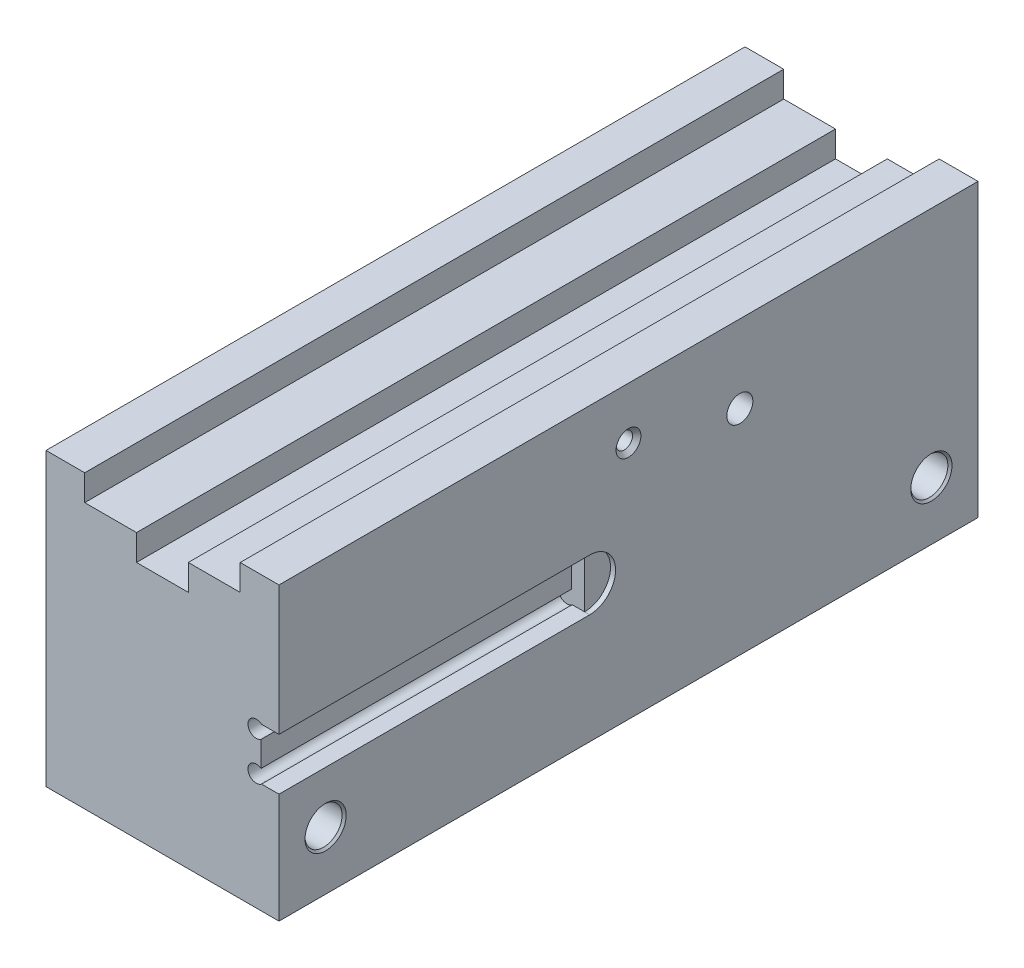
ISO-10303-21;
HEADER;
FILE_DESCRIPTION(('STEP AP214'),'2;1');
FILE_NAME('part.step','',(''),(''),'','','');
FILE_SCHEMA(('AUTOMOTIVE_DESIGN { 1 0 10303 214 1 1 1 1 }'));
ENDSEC;
DATA;
#1=APPLICATION_CONTEXT('core data for automotive mechanical design processes');
#2=APPLICATION_PROTOCOL_DEFINITION('international standard','automotive_design',2000,#1);
#3=PRODUCT_CONTEXT('',#1,'mechanical');
#4=PRODUCT('Part','Part','',(#3));
#5=PRODUCT_RELATED_PRODUCT_CATEGORY('part','',(#4));
#6=PRODUCT_DEFINITION_FORMATION('','',#4);
#7=PRODUCT_DEFINITION_CONTEXT('part definition',#1,'design');
#8=PRODUCT_DEFINITION('design','',#6,#7);
#9=PRODUCT_DEFINITION_SHAPE('','',#8);
#10=(LENGTH_UNIT() NAMED_UNIT(*) SI_UNIT(.MILLI.,.METRE.));
#11=(NAMED_UNIT(*) PLANE_ANGLE_UNIT() SI_UNIT($,.RADIAN.));
#12=(NAMED_UNIT(*) SI_UNIT($,.STERADIAN.) SOLID_ANGLE_UNIT());
#13=UNCERTAINTY_MEASURE_WITH_UNIT(LENGTH_MEASURE(1.E-05),#10,'distance_accuracy_value','');
#14=(GEOMETRIC_REPRESENTATION_CONTEXT(3) GLOBAL_UNCERTAINTY_ASSIGNED_CONTEXT((#13)) GLOBAL_UNIT_ASSIGNED_CONTEXT((#10,
#11,#12)) REPRESENTATION_CONTEXT('',''));
#15=CARTESIAN_POINT('',(0.,0.,0.));
#16=DIRECTION('',(0.,0.,1.));
#17=DIRECTION('',(1.,0.,0.));
#18=AXIS2_PLACEMENT_3D('',#15,#16,#17);
#19=CARTESIAN_POINT('',(51.5747,28.5623,-76.2));
#20=DIRECTION('',(0.,0.,1.));
#21=DIRECTION('',(1.,0.,0.));
#22=AXIS2_PLACEMENT_3D('',#19,#20,#21);
#23=PLANE('',#22);
#24=DIRECTION('',(1.,0.,0.));
#25=VECTOR('',#24,1.);
#26=CARTESIAN_POINT('',(52.8633589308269,26.9748,-76.2));
#27=LINE('',#26,#25);
#28=CARTESIAN_POINT('',(52.8633589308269,26.9748,-76.2));
#29=VERTEX_POINT('',#28);
#30=CARTESIAN_POINT('',(55.9181,26.9748,-76.2));
#31=VERTEX_POINT('',#30);
#32=EDGE_CURVE('E260',#29,#31,#27,.T.);
#33=ORIENTED_EDGE('',*,*,#32,.T.);
#34=DIRECTION('',(0.,1.,0.));
#35=VECTOR('',#34,1.);
#36=CARTESIAN_POINT('',(55.9181,28.5623,-76.2));
#37=LINE('',#36,#35);
#38=CARTESIAN_POINT('',(55.9181,39.6748,-76.2));
#39=VERTEX_POINT('',#38);
#40=EDGE_CURVE('E11',#31,#39,#37,.T.);
#41=ORIENTED_EDGE('',*,*,#40,.T.);
#42=DIRECTION('',(-1.,0.,0.));
#43=VECTOR('',#42,1.);
#44=CARTESIAN_POINT('',(52.8633589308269,39.6748,-76.2));
#45=LINE('',#44,#43);
#46=CARTESIAN_POINT('',(52.8633589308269,39.6748,-76.2));
#47=VERTEX_POINT('',#46);
#48=EDGE_CURVE('E263',#39,#47,#45,.T.);
#49=ORIENTED_EDGE('',*,*,#48,.T.);
#50=CARTESIAN_POINT('',(51.5747,38.0873,-76.2));
#51=DIRECTION('',(0.,0.,1.));
#52=DIRECTION('',(1.,0.,0.));
#53=AXIS2_PLACEMENT_3D('',#50,#51,#52);
#54=CIRCLE('',#53,2.04469999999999);
#55=CARTESIAN_POINT('',(52.7431,36.4093132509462,-76.2));
#56=VERTEX_POINT('',#55);
#57=EDGE_CURVE('E266',#47,#56,#54,.T.);
#58=ORIENTED_EDGE('',*,*,#57,.T.);
#59=DIRECTION('',(0.,-1.,0.));
#60=VECTOR('',#59,1.);
#61=CARTESIAN_POINT('',(52.7431,36.4093132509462,-76.2));
#62=LINE('',#61,#60);
#63=CARTESIAN_POINT('',(52.7431,30.2402867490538,-76.2));
#64=VERTEX_POINT('',#63);
#65=EDGE_CURVE('E269',#56,#64,#62,.T.);
#66=ORIENTED_EDGE('',*,*,#65,.T.);
#67=CARTESIAN_POINT('',(51.5747,28.5623,-76.2));
#68=DIRECTION('',(0.,0.,1.));
#69=DIRECTION('',(1.,0.,0.));
#70=AXIS2_PLACEMENT_3D('',#67,#68,#69);
#71=CIRCLE('',#70,2.0447);
#72=EDGE_CURVE('E255',#64,#29,#71,.T.);
#73=ORIENTED_EDGE('',*,*,#72,.T.);
#74=EDGE_LOOP('',(#33,#41,#49,#58,#66,#73));
#75=FACE_BOUND('',#74,.T.);
#76=ADVANCED_FACE('F37',(#75),#23,.T.);
#77=CARTESIAN_POINT('',(0.,71.4248,-171.45));
#78=DIRECTION('',(0.,1.,0.));
#79=DIRECTION('',(0.,0.,1.));
#80=AXIS2_PLACEMENT_3D('',#77,#78,#79);
#81=PLANE('',#80);
#82=DIRECTION('',(0.,0.,1.));
#83=VECTOR('',#82,1.);
#84=CARTESIAN_POINT('',(9.4996,71.4248,-171.45));
#85=LINE('',#84,#83);
#86=CARTESIAN_POINT('',(9.4996,71.4248,-171.45));
#87=VERTEX_POINT('',#86);
#88=CARTESIAN_POINT('',(9.4996,71.4248,0.));
#89=VERTEX_POINT('',#88);
#90=EDGE_CURVE('E397',#87,#89,#85,.T.);
#91=ORIENTED_EDGE('',*,*,#90,.F.);
#92=DIRECTION('',(-1.,0.,0.));
#93=VECTOR('',#92,1.);
#94=CARTESIAN_POINT('',(0.,71.4248,-171.45));
#95=LINE('',#94,#93);
#96=CARTESIAN_POINT('',(0.,71.4248,-171.45));
#97=VERTEX_POINT('',#96);
#98=EDGE_CURVE('E425',#87,#97,#95,.T.);
#99=ORIENTED_EDGE('',*,*,#98,.T.);
#100=DIRECTION('',(0.,0.,1.));
#101=VECTOR('',#100,1.);
#102=CARTESIAN_POINT('',(0.,71.4248,-171.45));
#103=LINE('',#102,#101);
#104=CARTESIAN_POINT('',(0.,71.4248,0.));
#105=VERTEX_POINT('',#104);
#106=EDGE_CURVE('E45',#97,#105,#103,.T.);
#107=ORIENTED_EDGE('',*,*,#106,.T.);
#108=DIRECTION('',(-1.,0.,0.));
#109=VECTOR('',#108,1.);
#110=CARTESIAN_POINT('',(0.,71.4248,0.));
#111=LINE('',#110,#109);
#112=EDGE_CURVE('E439',#89,#105,#111,.T.);
#113=ORIENTED_EDGE('',*,*,#112,.F.);
#114=EDGE_LOOP('',(#91,#99,#107,#113));
#115=FACE_BOUND('',#114,.T.);
#116=ADVANCED_FACE('F465',(#115),#81,.T.);
#117=CARTESIAN_POINT('',(0.,0.,-171.45));
#118=DIRECTION('',(-1.,0.,0.));
#119=DIRECTION('',(0.,0.,1.));
#120=AXIS2_PLACEMENT_3D('',#117,#118,#119);
#121=PLANE('',#120);
#122=DIRECTION('',(0.,-1.,0.));
#123=VECTOR('',#122,1.);
#124=CARTESIAN_POINT('',(0.,0.,0.));
#125=LINE('',#124,#123);
#126=CARTESIAN_POINT('',(0.,0.,0.));
#127=VERTEX_POINT('',#126);
#128=EDGE_CURVE('E399',#105,#127,#125,.T.);
#129=ORIENTED_EDGE('',*,*,#128,.F.);
#130=ORIENTED_EDGE('',*,*,#106,.F.);
#131=DIRECTION('',(0.,-1.,0.));
#132=VECTOR('',#131,1.);
#133=CARTESIAN_POINT('',(0.,0.,-171.45));
#134=LINE('',#133,#132);
#135=CARTESIAN_POINT('',(0.,0.,-171.45));
#136=VERTEX_POINT('',#135);
#137=EDGE_CURVE('E415',#97,#136,#134,.T.);
#138=ORIENTED_EDGE('',*,*,#137,.T.);
#139=DIRECTION('',(0.,0.,1.));
#140=VECTOR('',#139,1.);
#141=CARTESIAN_POINT('',(0.,0.,-171.45));
#142=LINE('',#141,#140);
#143=EDGE_CURVE('E429',#136,#127,#142,.T.);
#144=ORIENTED_EDGE('',*,*,#143,.T.);
#145=EDGE_LOOP('',(#129,#130,#138,#144));
#146=FACE_BOUND('',#145,.T.);
#147=ADVANCED_FACE('F39',(#146),#121,.T.);
#148=DIRECTION('',(0.,0.,1.));
#149=VECTOR('',#148,1.);
#150=CARTESIAN_POINT('',(47.625,71.4248,-171.45));
#151=LINE('',#150,#149);
#152=CARTESIAN_POINT('',(47.625,71.4248,-171.45));
#153=VERTEX_POINT('',#152);
#154=CARTESIAN_POINT('',(47.625,71.4248,0.));
#155=VERTEX_POINT('',#154);
#156=EDGE_CURVE('E400',#153,#155,#151,.T.);
#157=ORIENTED_EDGE('',*,*,#156,.T.);
#158=CARTESIAN_POINT('',(57.15,71.4248,0.));
#159=VERTEX_POINT('',#158);
#160=EDGE_CURVE('E419',#159,#155,#111,.T.);
#161=ORIENTED_EDGE('',*,*,#160,.F.);
#162=DIRECTION('',(0.,0.,1.));
#163=VECTOR('',#162,1.);
#164=CARTESIAN_POINT('',(57.15,71.4248,-171.45));
#165=LINE('',#164,#163);
#166=CARTESIAN_POINT('',(57.15,71.4248,-171.45));
#167=VERTEX_POINT('',#166);
#168=EDGE_CURVE('E444',#167,#159,#165,.T.);
#169=ORIENTED_EDGE('',*,*,#168,.F.);
#170=EDGE_CURVE('E426',#167,#153,#95,.T.);
#171=ORIENTED_EDGE('',*,*,#170,.T.);
#172=EDGE_LOOP('',(#157,#161,#169,#171));
#173=FACE_BOUND('',#172,.T.);
#174=ADVANCED_FACE('F502',(#173),#81,.T.);
#175=CARTESIAN_POINT('',(57.15,0.,-171.45));
#176=DIRECTION('',(1.,0.,0.));
#177=DIRECTION('',(0.,0.,-1.));
#178=AXIS2_PLACEMENT_3D('',#175,#176,#177);
#179=PLANE('',#178);
#180=CARTESIAN_POINT('',(57.15,58.7248,-85.725));
#181=DIRECTION('',(1.,0.,0.));
#182=DIRECTION('',(0.,0.,-1.));
#183=AXIS2_PLACEMENT_3D('',#180,#181,#182);
#184=CIRCLE('',#183,3.048);
#185=CARTESIAN_POINT('',(57.15,58.7248,-88.773));
#186=VERTEX_POINT('',#185);
#187=EDGE_CURVE('E210',#186,#186,#184,.T.);
#188=ORIENTED_EDGE('',*,*,#187,.F.);
#189=EDGE_LOOP('',(#188));
#190=FACE_BOUND('',#189,.T.);
#191=CARTESIAN_POINT('',(57.15,52.3748,-113.03));
#192=DIRECTION('',(1.,0.,0.));
#193=DIRECTION('',(0.,0.,-1.));
#194=AXIS2_PLACEMENT_3D('',#191,#192,#193);
#195=CIRCLE('',#194,3.19405);
#196=CARTESIAN_POINT('',(57.15,52.3748,-116.22405));
#197=VERTEX_POINT('',#196);
#198=EDGE_CURVE('E203',#197,#197,#195,.T.);
#199=ORIENTED_EDGE('',*,*,#198,.F.);
#200=EDGE_LOOP('',(#199));
#201=FACE_BOUND('',#200,.T.);
#202=CARTESIAN_POINT('',(57.15,14.2748,-11.43));
#203=DIRECTION('',(1.,0.,0.));
#204=DIRECTION('',(0.,0.,-1.));
#205=AXIS2_PLACEMENT_3D('',#202,#203,#204);
#206=CIRCLE('',#205,5.0546);
#207=CARTESIAN_POINT('',(57.15,14.2748,-16.4846));
#208=VERTEX_POINT('',#207);
#209=EDGE_CURVE('E215',#208,#208,#206,.T.);
#210=ORIENTED_EDGE('',*,*,#209,.F.);
#211=EDGE_LOOP('',(#210));
#212=FACE_BOUND('',#211,.T.);
#213=CARTESIAN_POINT('',(57.15,14.2748,-160.02));
#214=DIRECTION('',(1.,0.,0.));
#215=DIRECTION('',(0.,0.,-1.));
#216=AXIS2_PLACEMENT_3D('',#213,#214,#215);
#217=CIRCLE('',#216,5.0546);
#218=CARTESIAN_POINT('',(57.15,14.2748,-165.0746));
#219=VERTEX_POINT('',#218);
#220=EDGE_CURVE('E225',#219,#219,#217,.T.);
#221=ORIENTED_EDGE('',*,*,#220,.F.);
#222=EDGE_LOOP('',(#221));
#223=FACE_BOUND('',#222,.T.);
#224=CARTESIAN_POINT('',(57.15,33.3248,-76.2));
#225=DIRECTION('',(1.,0.,0.));
#226=DIRECTION('',(0.,0.,-1.));
#227=AXIS2_PLACEMENT_3D('',#224,#225,#226);
#228=CIRCLE('',#227,6.35);
#229=CARTESIAN_POINT('',(57.15,26.9748,-76.2));
#230=VERTEX_POINT('',#229);
#231=CARTESIAN_POINT('',(57.15,39.6748,-76.2));
#232=VERTEX_POINT('',#231);
#233=EDGE_CURVE('E252',#230,#232,#228,.T.);
#234=ORIENTED_EDGE('',*,*,#233,.F.);
#235=DIRECTION('',(0.,0.,1.));
#236=VECTOR('',#235,1.);
#237=CARTESIAN_POINT('',(57.15,26.9748,-76.2));
#238=LINE('',#237,#236);
#239=CARTESIAN_POINT('',(57.15,26.9748,0.));
#240=VERTEX_POINT('',#239);
#241=EDGE_CURVE('E293',#230,#240,#238,.T.);
#242=ORIENTED_EDGE('',*,*,#241,.T.);
#243=DIRECTION('',(0.,1.,0.));
#244=VECTOR('',#243,1.);
#245=CARTESIAN_POINT('',(57.15,0.,0.));
#246=LINE('',#245,#244);
#247=CARTESIAN_POINT('',(57.15,0.,0.));
#248=VERTEX_POINT('',#247);
#249=EDGE_CURVE('E436',#248,#240,#246,.T.);
#250=ORIENTED_EDGE('',*,*,#249,.F.);
#251=DIRECTION('',(0.,0.,1.));
#252=VECTOR('',#251,1.);
#253=CARTESIAN_POINT('',(57.15,0.,-171.45));
#254=LINE('',#253,#252);
#255=CARTESIAN_POINT('',(57.15,0.,-171.45));
#256=VERTEX_POINT('',#255);
#257=EDGE_CURVE('E447',#256,#248,#254,.T.);
#258=ORIENTED_EDGE('',*,*,#257,.F.);
#259=DIRECTION('',(0.,1.,0.));
#260=VECTOR('',#259,1.);
#261=CARTESIAN_POINT('',(57.15,0.,-171.45));
#262=LINE('',#261,#260);
#263=EDGE_CURVE('E422',#256,#167,#262,.T.);
#264=ORIENTED_EDGE('',*,*,#263,.T.);
#265=ORIENTED_EDGE('',*,*,#168,.T.);
#266=CARTESIAN_POINT('',(57.15,39.6748,0.));
#267=VERTEX_POINT('',#266);
#268=EDGE_CURVE('E435',#267,#159,#246,.T.);
#269=ORIENTED_EDGE('',*,*,#268,.F.);
#270=DIRECTION('',(0.,0.,1.));
#271=VECTOR('',#270,1.);
#272=CARTESIAN_POINT('',(57.15,39.6748,-76.2));
#273=LINE('',#272,#271);
#274=EDGE_CURVE('E291',#232,#267,#273,.T.);
#275=ORIENTED_EDGE('',*,*,#274,.F.);
#276=EDGE_LOOP('',(#234,#242,#250,#258,#264,#265,#269,#275));
#277=FACE_BOUND('',#276,.T.);
#278=ADVANCED_FACE('F473',(#190,#201,#212,#223,#277),#179,.T.);
#279=CARTESIAN_POINT('',(0.,0.,-171.45));
#280=DIRECTION('',(0.,-1.,0.));
#281=DIRECTION('',(0.,0.,-1.));
#282=AXIS2_PLACEMENT_3D('',#279,#280,#281);
#283=PLANE('',#282);
#284=CARTESIAN_POINT('',(26.9875,0.,-11.43));
#285=DIRECTION('',(0.,-1.,0.));
#286=DIRECTION('',(0.,0.,-1.));
#287=AXIS2_PLACEMENT_3D('',#284,#285,#286);
#288=CIRCLE('',#287,5.0546);
#289=CARTESIAN_POINT('',(26.9875,0.,-16.4846));
#290=VERTEX_POINT('',#289);
#291=EDGE_CURVE('E234',#290,#290,#288,.T.);
#292=ORIENTED_EDGE('',*,*,#291,.F.);
#293=EDGE_LOOP('',(#292));
#294=FACE_BOUND('',#293,.T.);
#295=CARTESIAN_POINT('',(26.9875,0.,-160.02));
#296=DIRECTION('',(0.,-1.,0.));
#297=DIRECTION('',(0.,0.,-1.));
#298=AXIS2_PLACEMENT_3D('',#295,#296,#297);
#299=CIRCLE('',#298,5.0546);
#300=CARTESIAN_POINT('',(26.9875,0.,-165.0746));
#301=VERTEX_POINT('',#300);
#302=EDGE_CURVE('E243',#301,#301,#299,.T.);
#303=ORIENTED_EDGE('',*,*,#302,.F.);
#304=EDGE_LOOP('',(#303));
#305=FACE_BOUND('',#304,.T.);
#306=CARTESIAN_POINT('',(7.9375,0.,-60.325));
#307=DIRECTION('',(0.,-1.,0.));
#308=DIRECTION('',(0.,0.,-1.));
#309=AXIS2_PLACEMENT_3D('',#306,#307,#308);
#310=CIRCLE('',#309,3.81);
#311=CARTESIAN_POINT('',(7.9375,0.,-64.135));
#312=VERTEX_POINT('',#311);
#313=EDGE_CURVE('E286',#312,#312,#310,.T.);
#314=ORIENTED_EDGE('',*,*,#313,.F.);
#315=EDGE_LOOP('',(#314));
#316=FACE_BOUND('',#315,.T.);
#317=CARTESIAN_POINT('',(46.0375,0.,-60.325));
#318=DIRECTION('',(0.,-1.,0.));
#319=DIRECTION('',(0.,0.,-1.));
#320=AXIS2_PLACEMENT_3D('',#317,#318,#319);
#321=CIRCLE('',#320,3.81);
#322=CARTESIAN_POINT('',(46.0375,0.,-64.135));
#323=VERTEX_POINT('',#322);
#324=EDGE_CURVE('E305',#323,#323,#321,.T.);
#325=ORIENTED_EDGE('',*,*,#324,.F.);
#326=EDGE_LOOP('',(#325));
#327=FACE_BOUND('',#326,.T.);
#328=CARTESIAN_POINT('',(46.0375,0.,-111.125));
#329=DIRECTION('',(0.,-1.,0.));
#330=DIRECTION('',(0.,0.,-1.));
#331=AXIS2_PLACEMENT_3D('',#328,#329,#330);
#332=CIRCLE('',#331,3.81);
#333=CARTESIAN_POINT('',(46.0375,0.,-114.935));
#334=VERTEX_POINT('',#333);
#335=EDGE_CURVE('E314',#334,#334,#332,.T.);
#336=ORIENTED_EDGE('',*,*,#335,.F.);
#337=EDGE_LOOP('',(#336));
#338=FACE_BOUND('',#337,.T.);
#339=CARTESIAN_POINT('',(7.9375,0.,-111.125));
#340=DIRECTION('',(0.,-1.,0.));
#341=DIRECTION('',(0.,0.,-1.));
#342=AXIS2_PLACEMENT_3D('',#339,#340,#341);
#343=CIRCLE('',#342,3.81);
#344=CARTESIAN_POINT('',(7.9375,0.,-114.935));
#345=VERTEX_POINT('',#344);
#346=EDGE_CURVE('E323',#345,#345,#343,.T.);
#347=ORIENTED_EDGE('',*,*,#346,.F.);
#348=EDGE_LOOP('',(#347));
#349=FACE_BOUND('',#348,.T.);
#350=CARTESIAN_POINT('',(7.9375,0.,-85.725));
#351=DIRECTION('',(0.,-1.,0.));
#352=DIRECTION('',(0.,0.,-1.));
#353=AXIS2_PLACEMENT_3D('',#350,#351,#352);
#354=CIRCLE('',#353,3.2004);
#355=CARTESIAN_POINT('',(7.9375,0.,-88.9254));
#356=VERTEX_POINT('',#355);
#357=EDGE_CURVE('E337',#356,#356,#354,.T.);
#358=ORIENTED_EDGE('',*,*,#357,.F.);
#359=EDGE_LOOP('',(#358));
#360=FACE_BOUND('',#359,.T.);
#361=CARTESIAN_POINT('',(46.0375,0.,-85.725));
#362=DIRECTION('',(0.,-1.,0.));
#363=DIRECTION('',(0.,0.,-1.));
#364=AXIS2_PLACEMENT_3D('',#361,#362,#363);
#365=CIRCLE('',#364,3.2004);
#366=CARTESIAN_POINT('',(46.0375,0.,-88.9254));
#367=VERTEX_POINT('',#366);
#368=EDGE_CURVE('E343',#367,#367,#365,.T.);
#369=ORIENTED_EDGE('',*,*,#368,.F.);
#370=EDGE_LOOP('',(#369));
#371=FACE_BOUND('',#370,.T.);
#372=CARTESIAN_POINT('',(26.9875,0.,-136.525));
#373=DIRECTION('',(0.,-1.,0.));
#374=DIRECTION('',(0.,0.,-1.));
#375=AXIS2_PLACEMENT_3D('',#372,#373,#374);
#376=CIRCLE('',#375,3.2004);
#377=CARTESIAN_POINT('',(26.9875,0.,-139.7254));
#378=VERTEX_POINT('',#377);
#379=EDGE_CURVE('E332',#378,#378,#376,.T.);
#380=ORIENTED_EDGE('',*,*,#379,.F.);
#381=EDGE_LOOP('',(#380));
#382=FACE_BOUND('',#381,.T.);
#383=CARTESIAN_POINT('',(26.9875,0.,-34.925));
#384=DIRECTION('',(0.,-1.,0.));
#385=DIRECTION('',(0.,0.,-1.));
#386=AXIS2_PLACEMENT_3D('',#383,#384,#385);
#387=CIRCLE('',#386,3.2004);
#388=CARTESIAN_POINT('',(26.9875,0.,-38.1254));
#389=VERTEX_POINT('',#388);
#390=EDGE_CURVE('E336',#389,#389,#387,.T.);
#391=ORIENTED_EDGE('',*,*,#390,.F.);
#392=EDGE_LOOP('',(#391));
#393=FACE_BOUND('',#392,.T.);
#394=DIRECTION('',(1.,0.,0.));
#395=VECTOR('',#394,1.);
#396=CARTESIAN_POINT('',(0.,0.,0.));
#397=LINE('',#396,#395);
#398=EDGE_CURVE('E432',#127,#248,#397,.T.);
#399=ORIENTED_EDGE('',*,*,#398,.F.);
#400=ORIENTED_EDGE('',*,*,#143,.F.);
#401=DIRECTION('',(1.,0.,0.));
#402=VECTOR('',#401,1.);
#403=CARTESIAN_POINT('',(0.,0.,-171.45));
#404=LINE('',#403,#402);
#405=EDGE_CURVE('E418',#136,#256,#404,.T.);
#406=ORIENTED_EDGE('',*,*,#405,.T.);
#407=ORIENTED_EDGE('',*,*,#257,.T.);
#408=EDGE_LOOP('',(#399,#400,#406,#407));
#409=FACE_BOUND('',#408,.T.);
#410=ADVANCED_FACE('F455',(#294,#305,#316,#327,#338,#349,#360,#371,#382,#393,#409),#283,.T.);
#411=CARTESIAN_POINT('',(0.,0.,-171.45));
#412=DIRECTION('',(0.,0.,-1.));
#413=DIRECTION('',(-1.,0.,0.));
#414=AXIS2_PLACEMENT_3D('',#411,#412,#413);
#415=PLANE('',#414);
#416=DIRECTION('',(0.,-1.,0.));
#417=VECTOR('',#416,1.);
#418=CARTESIAN_POINT('',(9.4996,71.4248,-171.45));
#419=LINE('',#418,#417);
#420=CARTESIAN_POINT('',(9.4996,65.0748,-171.45));
#421=VERTEX_POINT('',#420);
#422=EDGE_CURVE('E357',#87,#421,#419,.T.);
#423=ORIENTED_EDGE('',*,*,#422,.T.);
#424=DIRECTION('',(1.,0.,0.));
#425=VECTOR('',#424,1.);
#426=CARTESIAN_POINT('',(9.4996,65.0748,-171.45));
#427=LINE('',#426,#425);
#428=CARTESIAN_POINT('',(22.1996,65.0748,-171.45));
#429=VERTEX_POINT('',#428);
#430=EDGE_CURVE('E360',#421,#429,#427,.T.);
#431=ORIENTED_EDGE('',*,*,#430,.T.);
#432=DIRECTION('',(0.,-1.,0.));
#433=VECTOR('',#432,1.);
#434=CARTESIAN_POINT('',(22.1996,65.0748,-171.45));
#435=LINE('',#434,#433);
#436=CARTESIAN_POINT('',(22.1996,58.7248,-171.45));
#437=VERTEX_POINT('',#436);
#438=EDGE_CURVE('E364',#429,#437,#435,.T.);
#439=ORIENTED_EDGE('',*,*,#438,.T.);
#440=DIRECTION('',(1.,0.,0.));
#441=VECTOR('',#440,1.);
#442=CARTESIAN_POINT('',(22.1996,58.7248,-171.45));
#443=LINE('',#442,#441);
#444=CARTESIAN_POINT('',(34.8996,58.7248,-171.45));
#445=VERTEX_POINT('',#444);
#446=EDGE_CURVE('E367',#437,#445,#443,.T.);
#447=ORIENTED_EDGE('',*,*,#446,.T.);
#448=DIRECTION('',(0.,1.,0.));
#449=VECTOR('',#448,1.);
#450=CARTESIAN_POINT('',(34.8996,65.0748,-171.45));
#451=LINE('',#450,#449);
#452=CARTESIAN_POINT('',(34.8996,65.0748,-171.45));
#453=VERTEX_POINT('',#452);
#454=EDGE_CURVE('E370',#445,#453,#451,.T.);
#455=ORIENTED_EDGE('',*,*,#454,.T.);
#456=DIRECTION('',(1.,0.,0.));
#457=VECTOR('',#456,1.);
#458=CARTESIAN_POINT('',(34.8996,65.0748,-171.45));
#459=LINE('',#458,#457);
#460=CARTESIAN_POINT('',(47.625,65.0748,-171.45));
#461=VERTEX_POINT('',#460);
#462=EDGE_CURVE('E373',#453,#461,#459,.T.);
#463=ORIENTED_EDGE('',*,*,#462,.T.);
#464=DIRECTION('',(0.,1.,0.));
#465=VECTOR('',#464,1.);
#466=CARTESIAN_POINT('',(47.625,71.4248,-171.45));
#467=LINE('',#466,#465);
#468=EDGE_CURVE('E376',#461,#153,#467,.T.);
#469=ORIENTED_EDGE('',*,*,#468,.T.);
#470=ORIENTED_EDGE('',*,*,#170,.F.);
#471=ORIENTED_EDGE('',*,*,#263,.F.);
#472=ORIENTED_EDGE('',*,*,#405,.F.);
#473=ORIENTED_EDGE('',*,*,#137,.F.);
#474=ORIENTED_EDGE('',*,*,#98,.F.);
#475=EDGE_LOOP('',(#423,#431,#439,#447,#455,#463,#469,#470,#471,#472,#473,#474));
#476=FACE_BOUND('',#475,.T.);
#477=ADVANCED_FACE('F468',(#476),#415,.T.);
#478=CARTESIAN_POINT('',(0.,0.,0.));
#479=DIRECTION('',(0.,0.,-1.));
#480=DIRECTION('',(-1.,0.,0.));
#481=AXIS2_PLACEMENT_3D('',#478,#479,#480);
#482=PLANE('',#481);
#483=CARTESIAN_POINT('',(51.5747,38.0873,0.));
#484=DIRECTION('',(0.,0.,1.));
#485=DIRECTION('',(1.,0.,0.));
#486=AXIS2_PLACEMENT_3D('',#483,#484,#485);
#487=CIRCLE('',#486,2.04469999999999);
#488=CARTESIAN_POINT('',(52.8633589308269,39.6748,0.));
#489=VERTEX_POINT('',#488);
#490=CARTESIAN_POINT('',(52.7431,36.4093132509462,0.));
#491=VERTEX_POINT('',#490);
#492=EDGE_CURVE('E279',#489,#491,#487,.T.);
#493=ORIENTED_EDGE('',*,*,#492,.F.);
#494=DIRECTION('',(-1.,0.,0.));
#495=VECTOR('',#494,1.);
#496=CARTESIAN_POINT('',(52.8633589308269,39.6748,0.));
#497=LINE('',#496,#495);
#498=EDGE_CURVE('E276',#267,#489,#497,.T.);
#499=ORIENTED_EDGE('',*,*,#498,.F.);
#500=ORIENTED_EDGE('',*,*,#268,.T.);
#501=ORIENTED_EDGE('',*,*,#160,.T.);
#502=DIRECTION('',(0.,1.,0.));
#503=VECTOR('',#502,1.);
#504=CARTESIAN_POINT('',(47.625,71.4248,0.));
#505=LINE('',#504,#503);
#506=CARTESIAN_POINT('',(47.625,65.0748,0.));
#507=VERTEX_POINT('',#506);
#508=EDGE_CURVE('E361',#507,#155,#505,.T.);
#509=ORIENTED_EDGE('',*,*,#508,.F.);
#510=DIRECTION('',(1.,0.,0.));
#511=VECTOR('',#510,1.);
#512=CARTESIAN_POINT('',(34.8996,65.0748,0.));
#513=LINE('',#512,#511);
#514=CARTESIAN_POINT('',(34.8996,65.0748,0.));
#515=VERTEX_POINT('',#514);
#516=EDGE_CURVE('E393',#515,#507,#513,.T.);
#517=ORIENTED_EDGE('',*,*,#516,.F.);
#518=DIRECTION('',(0.,1.,0.));
#519=VECTOR('',#518,1.);
#520=CARTESIAN_POINT('',(34.8996,65.0748,0.));
#521=LINE('',#520,#519);
#522=CARTESIAN_POINT('',(34.8996,58.7248,0.));
#523=VERTEX_POINT('',#522);
#524=EDGE_CURVE('E390',#523,#515,#521,.T.);
#525=ORIENTED_EDGE('',*,*,#524,.F.);
#526=DIRECTION('',(1.,0.,0.));
#527=VECTOR('',#526,1.);
#528=CARTESIAN_POINT('',(22.1996,58.7248,0.));
#529=LINE('',#528,#527);
#530=CARTESIAN_POINT('',(22.1996,58.7248,0.));
#531=VERTEX_POINT('',#530);
#532=EDGE_CURVE('E387',#531,#523,#529,.T.);
#533=ORIENTED_EDGE('',*,*,#532,.F.);
#534=DIRECTION('',(0.,-1.,0.));
#535=VECTOR('',#534,1.);
#536=CARTESIAN_POINT('',(22.1996,65.0748,0.));
#537=LINE('',#536,#535);
#538=CARTESIAN_POINT('',(22.1996,65.0748,0.));
#539=VERTEX_POINT('',#538);
#540=EDGE_CURVE('E384',#539,#531,#537,.T.);
#541=ORIENTED_EDGE('',*,*,#540,.F.);
#542=DIRECTION('',(1.,0.,0.));
#543=VECTOR('',#542,1.);
#544=CARTESIAN_POINT('',(9.4996,65.0748,0.));
#545=LINE('',#544,#543);
#546=CARTESIAN_POINT('',(9.4996,65.0748,0.));
#547=VERTEX_POINT('',#546);
#548=EDGE_CURVE('E381',#547,#539,#545,.T.);
#549=ORIENTED_EDGE('',*,*,#548,.F.);
#550=DIRECTION('',(0.,-1.,0.));
#551=VECTOR('',#550,1.);
#552=CARTESIAN_POINT('',(9.4996,71.4248,0.));
#553=LINE('',#552,#551);
#554=EDGE_CURVE('E354',#89,#547,#553,.T.);
#555=ORIENTED_EDGE('',*,*,#554,.F.);
#556=ORIENTED_EDGE('',*,*,#112,.T.);
#557=ORIENTED_EDGE('',*,*,#128,.T.);
#558=ORIENTED_EDGE('',*,*,#398,.T.);
#559=ORIENTED_EDGE('',*,*,#249,.T.);
#560=DIRECTION('',(1.,0.,0.));
#561=VECTOR('',#560,1.);
#562=CARTESIAN_POINT('',(52.8633589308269,26.9748,0.));
#563=LINE('',#562,#561);
#564=CARTESIAN_POINT('',(52.8633589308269,26.9748,0.));
#565=VERTEX_POINT('',#564);
#566=EDGE_CURVE('E274',#565,#240,#563,.T.);
#567=ORIENTED_EDGE('',*,*,#566,.F.);
#568=CARTESIAN_POINT('',(51.5747,28.5623,0.));
#569=DIRECTION('',(0.,0.,1.));
#570=DIRECTION('',(1.,0.,0.));
#571=AXIS2_PLACEMENT_3D('',#568,#569,#570);
#572=CIRCLE('',#571,2.0447);
#573=CARTESIAN_POINT('',(52.7431,30.2402867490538,0.));
#574=VERTEX_POINT('',#573);
#575=EDGE_CURVE('E59',#574,#565,#572,.T.);
#576=ORIENTED_EDGE('',*,*,#575,.F.);
#577=DIRECTION('',(0.,-1.,0.));
#578=VECTOR('',#577,1.);
#579=CARTESIAN_POINT('',(52.7431,36.4093132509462,0.));
#580=LINE('',#579,#578);
#581=EDGE_CURVE('E259',#491,#574,#580,.T.);
#582=ORIENTED_EDGE('',*,*,#581,.F.);
#583=EDGE_LOOP('',(#493,#499,#500,#501,#509,#517,#525,#533,#541,#549,#555,#556,#557,#558,#559,
#567,#576,#582));
#584=FACE_BOUND('',#583,.T.);
#585=ADVANCED_FACE('F459',(#584),#482,.F.);
#586=CARTESIAN_POINT('',(9.4996,71.4248,-171.45));
#587=DIRECTION('',(-1.,0.,0.));
#588=DIRECTION('',(0.,0.,1.));
#589=AXIS2_PLACEMENT_3D('',#586,#587,#588);
#590=PLANE('',#589);
#591=ORIENTED_EDGE('',*,*,#554,.T.);
#592=DIRECTION('',(0.,0.,1.));
#593=VECTOR('',#592,1.);
#594=CARTESIAN_POINT('',(9.4996,65.0748,-171.45));
#595=LINE('',#594,#593);
#596=EDGE_CURVE('E379',#421,#547,#595,.T.);
#597=ORIENTED_EDGE('',*,*,#596,.F.);
#598=ORIENTED_EDGE('',*,*,#422,.F.);
#599=ORIENTED_EDGE('',*,*,#90,.T.);
#600=EDGE_LOOP('',(#591,#597,#598,#599));
#601=FACE_BOUND('',#600,.T.);
#602=ADVANCED_FACE('F525',(#601),#590,.F.);
#603=CARTESIAN_POINT('',(47.625,71.4248,-171.45));
#604=DIRECTION('',(1.,0.,0.));
#605=DIRECTION('',(0.,0.,-1.));
#606=AXIS2_PLACEMENT_3D('',#603,#604,#605);
#607=PLANE('',#606);
#608=ORIENTED_EDGE('',*,*,#508,.T.);
#609=ORIENTED_EDGE('',*,*,#156,.F.);
#610=ORIENTED_EDGE('',*,*,#468,.F.);
#611=DIRECTION('',(0.,0.,1.));
#612=VECTOR('',#611,1.);
#613=CARTESIAN_POINT('',(47.625,65.0748,-171.45));
#614=LINE('',#613,#612);
#615=EDGE_CURVE('E403',#461,#507,#614,.T.);
#616=ORIENTED_EDGE('',*,*,#615,.T.);
#617=EDGE_LOOP('',(#608,#609,#610,#616));
#618=FACE_BOUND('',#617,.T.);
#619=ADVANCED_FACE('F505',(#618),#607,.F.);
#620=CARTESIAN_POINT('',(34.8996,65.0748,-171.45));
#621=DIRECTION('',(0.,-1.,0.));
#622=DIRECTION('',(0.,0.,-1.));
#623=AXIS2_PLACEMENT_3D('',#620,#621,#622);
#624=PLANE('',#623);
#625=ORIENTED_EDGE('',*,*,#516,.T.);
#626=ORIENTED_EDGE('',*,*,#615,.F.);
#627=ORIENTED_EDGE('',*,*,#462,.F.);
#628=DIRECTION('',(0.,0.,1.));
#629=VECTOR('',#628,1.);
#630=CARTESIAN_POINT('',(34.8996,65.0748,-171.45));
#631=LINE('',#630,#629);
#632=EDGE_CURVE('E405',#453,#515,#631,.T.);
#633=ORIENTED_EDGE('',*,*,#632,.T.);
#634=EDGE_LOOP('',(#625,#626,#627,#633));
#635=FACE_BOUND('',#634,.T.);
#636=ADVANCED_FACE('F509',(#635),#624,.F.);
#637=CARTESIAN_POINT('',(34.8996,65.0748,-171.45));
#638=DIRECTION('',(1.,0.,0.));
#639=DIRECTION('',(0.,0.,-1.));
#640=AXIS2_PLACEMENT_3D('',#637,#638,#639);
#641=PLANE('',#640);
#642=ORIENTED_EDGE('',*,*,#524,.T.);
#643=ORIENTED_EDGE('',*,*,#632,.F.);
#644=ORIENTED_EDGE('',*,*,#454,.F.);
#645=DIRECTION('',(0.,0.,1.));
#646=VECTOR('',#645,1.);
#647=CARTESIAN_POINT('',(34.8996,58.7248,-171.45));
#648=LINE('',#647,#646);
#649=EDGE_CURVE('E407',#445,#523,#648,.T.);
#650=ORIENTED_EDGE('',*,*,#649,.T.);
#651=EDGE_LOOP('',(#642,#643,#644,#650));
#652=FACE_BOUND('',#651,.T.);
#653=ADVANCED_FACE('F514',(#652),#641,.F.);
#654=CARTESIAN_POINT('',(22.1996,58.7248,-171.45));
#655=DIRECTION('',(0.,-1.,0.));
#656=DIRECTION('',(1.,0.,0.));
#657=AXIS2_PLACEMENT_3D('',#654,#655,#656);
#658=PLANE('',#657);
#659=ORIENTED_EDGE('',*,*,#532,.T.);
#660=ORIENTED_EDGE('',*,*,#649,.F.);
#661=ORIENTED_EDGE('',*,*,#446,.F.);
#662=DIRECTION('',(0.,0.,1.));
#663=VECTOR('',#662,1.);
#664=CARTESIAN_POINT('',(22.1996,58.7248,-171.45));
#665=LINE('',#664,#663);
#666=EDGE_CURVE('E409',#437,#531,#665,.T.);
#667=ORIENTED_EDGE('',*,*,#666,.T.);
#668=EDGE_LOOP('',(#659,#660,#661,#667));
#669=FACE_BOUND('',#668,.T.);
#670=ADVANCED_FACE('F517',(#669),#658,.F.);
#671=CARTESIAN_POINT('',(22.1996,65.0748,-171.45));
#672=DIRECTION('',(-1.,0.,0.));
#673=DIRECTION('',(0.,-1.,0.));
#674=AXIS2_PLACEMENT_3D('',#671,#672,#673);
#675=PLANE('',#674);
#676=ORIENTED_EDGE('',*,*,#540,.T.);
#677=ORIENTED_EDGE('',*,*,#666,.F.);
#678=ORIENTED_EDGE('',*,*,#438,.F.);
#679=DIRECTION('',(0.,0.,1.));
#680=VECTOR('',#679,1.);
#681=CARTESIAN_POINT('',(22.1996,65.0748,-171.45));
#682=LINE('',#681,#680);
#683=EDGE_CURVE('E411',#429,#539,#682,.T.);
#684=ORIENTED_EDGE('',*,*,#683,.T.);
#685=EDGE_LOOP('',(#676,#677,#678,#684));
#686=FACE_BOUND('',#685,.T.);
#687=ADVANCED_FACE('F520',(#686),#675,.F.);
#688=CARTESIAN_POINT('',(9.4996,65.0748,-171.45));
#689=DIRECTION('',(0.,-1.,0.));
#690=DIRECTION('',(1.,0.,0.));
#691=AXIS2_PLACEMENT_3D('',#688,#689,#690);
#692=PLANE('',#691);
#693=ORIENTED_EDGE('',*,*,#548,.T.);
#694=ORIENTED_EDGE('',*,*,#683,.F.);
#695=ORIENTED_EDGE('',*,*,#430,.F.);
#696=ORIENTED_EDGE('',*,*,#596,.T.);
#697=EDGE_LOOP('',(#693,#694,#695,#696));
#698=FACE_BOUND('',#697,.T.);
#699=ADVANCED_FACE('F522',(#698),#692,.F.);
#700=CARTESIAN_POINT('',(26.9875,6.35,-34.925));
#701=DIRECTION('',(0.,-1.,0.));
#702=DIRECTION('',(0.,0.,-1.));
#703=AXIS2_PLACEMENT_3D('',#700,#701,#702);
#704=CYLINDRICAL_SURFACE('',#703,3.2004);
#705=CARTESIAN_POINT('',(26.9875,6.35,-34.925));
#706=DIRECTION('',(0.,-1.,0.));
#707=DIRECTION('',(0.,0.,-1.));
#708=AXIS2_PLACEMENT_3D('',#705,#706,#707);
#709=CIRCLE('',#708,3.2004);
#710=CARTESIAN_POINT('',(26.9875,6.35,-38.1254));
#711=VERTEX_POINT('',#710);
#712=EDGE_CURVE('E351',#711,#711,#709,.T.);
#713=ORIENTED_EDGE('',*,*,#712,.F.);
#714=EDGE_LOOP('',(#713));
#715=FACE_BOUND('',#714,.T.);
#716=ORIENTED_EDGE('',*,*,#390,.T.);
#717=EDGE_LOOP('',(#716));
#718=FACE_BOUND('',#717,.T.);
#719=ADVANCED_FACE('F631',(#715,#718),#704,.F.);
#720=CARTESIAN_POINT('',(26.9875,6.35,-34.925));
#721=DIRECTION('',(0.,-1.,0.));
#722=DIRECTION('',(0.,0.,-1.));
#723=AXIS2_PLACEMENT_3D('',#720,#721,#722);
#724=PLANE('',#723);
#725=ORIENTED_EDGE('',*,*,#712,.T.);
#726=EDGE_LOOP('',(#725));
#727=FACE_BOUND('',#726,.T.);
#728=ADVANCED_FACE('F627',(#727),#724,.T.);
#729=CARTESIAN_POINT('',(26.9875,6.35,-136.525));
#730=DIRECTION('',(0.,-1.,0.));
#731=DIRECTION('',(0.,0.,-1.));
#732=AXIS2_PLACEMENT_3D('',#729,#730,#731);
#733=CYLINDRICAL_SURFACE('',#732,3.2004);
#734=CARTESIAN_POINT('',(26.9875,6.35,-136.525));
#735=DIRECTION('',(0.,-1.,0.));
#736=DIRECTION('',(0.,0.,-1.));
#737=AXIS2_PLACEMENT_3D('',#734,#735,#736);
#738=CIRCLE('',#737,3.2004);
#739=CARTESIAN_POINT('',(26.9875,6.35,-139.7254));
#740=VERTEX_POINT('',#739);
#741=EDGE_CURVE('E346',#740,#740,#738,.T.);
#742=ORIENTED_EDGE('',*,*,#741,.F.);
#743=EDGE_LOOP('',(#742));
#744=FACE_BOUND('',#743,.T.);
#745=ORIENTED_EDGE('',*,*,#379,.T.);
#746=EDGE_LOOP('',(#745));
#747=FACE_BOUND('',#746,.T.);
#748=ADVANCED_FACE('F623',(#744,#747),#733,.F.);
#749=CARTESIAN_POINT('',(26.9875,6.35,-136.525));
#750=DIRECTION('',(0.,-1.,0.));
#751=DIRECTION('',(0.,0.,-1.));
#752=AXIS2_PLACEMENT_3D('',#749,#750,#751);
#753=PLANE('',#752);
#754=ORIENTED_EDGE('',*,*,#741,.T.);
#755=EDGE_LOOP('',(#754));
#756=FACE_BOUND('',#755,.T.);
#757=ADVANCED_FACE('F619',(#756),#753,.T.);
#758=CARTESIAN_POINT('',(46.0375,6.35,-85.725));
#759=DIRECTION('',(0.,-1.,0.));
#760=DIRECTION('',(0.,0.,-1.));
#761=AXIS2_PLACEMENT_3D('',#758,#759,#760);
#762=CYLINDRICAL_SURFACE('',#761,3.2004);
#763=CARTESIAN_POINT('',(46.0375,6.35,-85.725));
#764=DIRECTION('',(0.,-1.,0.));
#765=DIRECTION('',(0.,0.,-1.));
#766=AXIS2_PLACEMENT_3D('',#763,#764,#765);
#767=CIRCLE('',#766,3.2004);
#768=CARTESIAN_POINT('',(46.0375,6.35,-88.9254));
#769=VERTEX_POINT('',#768);
#770=EDGE_CURVE('E340',#769,#769,#767,.T.);
#771=ORIENTED_EDGE('',*,*,#770,.F.);
#772=EDGE_LOOP('',(#771));
#773=FACE_BOUND('',#772,.T.);
#774=ORIENTED_EDGE('',*,*,#368,.T.);
#775=EDGE_LOOP('',(#774));
#776=FACE_BOUND('',#775,.T.);
#777=ADVANCED_FACE('F615',(#773,#776),#762,.F.);
#778=CARTESIAN_POINT('',(46.0375,6.35,-85.725));
#779=DIRECTION('',(0.,-1.,0.));
#780=DIRECTION('',(0.,0.,-1.));
#781=AXIS2_PLACEMENT_3D('',#778,#779,#780);
#782=PLANE('',#781);
#783=ORIENTED_EDGE('',*,*,#770,.T.);
#784=EDGE_LOOP('',(#783));
#785=FACE_BOUND('',#784,.T.);
#786=ADVANCED_FACE('F611',(#785),#782,.T.);
#787=CARTESIAN_POINT('',(7.9375,6.35,-85.725));
#788=DIRECTION('',(0.,-1.,0.));
#789=DIRECTION('',(0.,0.,-1.));
#790=AXIS2_PLACEMENT_3D('',#787,#788,#789);
#791=CYLINDRICAL_SURFACE('',#790,3.2004);
#792=CARTESIAN_POINT('',(7.9375,6.35,-85.725));
#793=DIRECTION('',(0.,-1.,0.));
#794=DIRECTION('',(0.,0.,-1.));
#795=AXIS2_PLACEMENT_3D('',#792,#793,#794);
#796=CIRCLE('',#795,3.2004);
#797=CARTESIAN_POINT('',(7.9375,6.35,-88.9254));
#798=VERTEX_POINT('',#797);
#799=EDGE_CURVE('E333',#798,#798,#796,.T.);
#800=ORIENTED_EDGE('',*,*,#799,.F.);
#801=EDGE_LOOP('',(#800));
#802=FACE_BOUND('',#801,.T.);
#803=ORIENTED_EDGE('',*,*,#357,.T.);
#804=EDGE_LOOP('',(#803));
#805=FACE_BOUND('',#804,.T.);
#806=ADVANCED_FACE('F607',(#802,#805),#791,.F.);
#807=CARTESIAN_POINT('',(7.9375,6.35,-85.725));
#808=DIRECTION('',(0.,-1.,0.));
#809=DIRECTION('',(0.,0.,-1.));
#810=AXIS2_PLACEMENT_3D('',#807,#808,#809);
#811=PLANE('',#810);
#812=ORIENTED_EDGE('',*,*,#799,.T.);
#813=EDGE_LOOP('',(#812));
#814=FACE_BOUND('',#813,.T.);
#815=ADVANCED_FACE('F603',(#814),#811,.T.);
#816=CARTESIAN_POINT('',(7.9375,11.43,-111.125));
#817=DIRECTION('',(0.,-1.,0.));
#818=DIRECTION('',(0.,0.,-1.));
#819=AXIS2_PLACEMENT_3D('',#816,#817,#818);
#820=CONICAL_SURFACE('',#819,2.5527,1.02974425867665);
#821=CARTESIAN_POINT('',(7.9375,12.9638169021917,-111.125));
#822=VERTEX_POINT('',#821);
#823=VERTEX_LOOP('',#822);
#824=FACE_BOUND('',#823,.T.);
#825=CARTESIAN_POINT('',(7.9375,11.43,-111.125));
#826=DIRECTION('',(0.,-1.,0.));
#827=DIRECTION('',(0.,0.,-1.));
#828=AXIS2_PLACEMENT_3D('',#825,#826,#827);
#829=CIRCLE('',#828,2.5527);
#830=CARTESIAN_POINT('',(7.9375,11.43,-113.6777));
#831=VERTEX_POINT('',#830);
#832=EDGE_CURVE('E329',#831,#831,#829,.T.);
#833=ORIENTED_EDGE('',*,*,#832,.T.);
#834=EDGE_LOOP('',(#833));
#835=FACE_BOUND('',#834,.T.);
#836=ADVANCED_FACE('F599',(#824,#835),#820,.F.);
#837=CARTESIAN_POINT('',(7.9375,0.,-111.125));
#838=DIRECTION('',(0.,-1.,0.));
#839=DIRECTION('',(0.,0.,-1.));
#840=AXIS2_PLACEMENT_3D('',#837,#838,#839);
#841=CYLINDRICAL_SURFACE('',#840,2.5527);
#842=ORIENTED_EDGE('',*,*,#832,.F.);
#843=EDGE_LOOP('',(#842));
#844=FACE_BOUND('',#843,.T.);
#845=CARTESIAN_POINT('',(7.9375,1.2573,-111.125));
#846=DIRECTION('',(0.,-1.,0.));
#847=DIRECTION('',(0.,0.,-1.));
#848=AXIS2_PLACEMENT_3D('',#845,#846,#847);
#849=CIRCLE('',#848,2.5527);
#850=CARTESIAN_POINT('',(7.9375,1.2573,-113.6777));
#851=VERTEX_POINT('',#850);
#852=EDGE_CURVE('E326',#851,#851,#849,.T.);
#853=ORIENTED_EDGE('',*,*,#852,.T.);
#854=EDGE_LOOP('',(#853));
#855=FACE_BOUND('',#854,.T.);
#856=ADVANCED_FACE('F595',(#844,#855),#841,.F.);
#857=CARTESIAN_POINT('',(7.9375,0.,-111.125));
#858=DIRECTION('',(0.,-1.,0.));
#859=DIRECTION('',(0.,0.,-1.));
#860=AXIS2_PLACEMENT_3D('',#857,#858,#859);
#861=CONICAL_SURFACE('',#860,3.81,0.785398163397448);
#862=ORIENTED_EDGE('',*,*,#852,.F.);
#863=EDGE_LOOP('',(#862));
#864=FACE_BOUND('',#863,.T.);
#865=ORIENTED_EDGE('',*,*,#346,.T.);
#866=EDGE_LOOP('',(#865));
#867=FACE_BOUND('',#866,.T.);
#868=ADVANCED_FACE('F591',(#864,#867),#861,.F.);
#869=CARTESIAN_POINT('',(46.0375,11.43,-111.125));
#870=DIRECTION('',(0.,-1.,0.));
#871=DIRECTION('',(0.,0.,-1.));
#872=AXIS2_PLACEMENT_3D('',#869,#870,#871);
#873=CONICAL_SURFACE('',#872,2.5527,1.02974425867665);
#874=CARTESIAN_POINT('',(46.0375,12.9638169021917,-111.125));
#875=VERTEX_POINT('',#874);
#876=VERTEX_LOOP('',#875);
#877=FACE_BOUND('',#876,.T.);
#878=CARTESIAN_POINT('',(46.0375,11.43,-111.125));
#879=DIRECTION('',(0.,-1.,0.));
#880=DIRECTION('',(0.,0.,-1.));
#881=AXIS2_PLACEMENT_3D('',#878,#879,#880);
#882=CIRCLE('',#881,2.5527);
#883=CARTESIAN_POINT('',(46.0375,11.43,-113.6777));
#884=VERTEX_POINT('',#883);
#885=EDGE_CURVE('E320',#884,#884,#882,.T.);
#886=ORIENTED_EDGE('',*,*,#885,.T.);
#887=EDGE_LOOP('',(#886));
#888=FACE_BOUND('',#887,.T.);
#889=ADVANCED_FACE('F587',(#877,#888),#873,.F.);
#890=CARTESIAN_POINT('',(46.0375,0.,-111.125));
#891=DIRECTION('',(0.,-1.,0.));
#892=DIRECTION('',(0.,0.,-1.));
#893=AXIS2_PLACEMENT_3D('',#890,#891,#892);
#894=CYLINDRICAL_SURFACE('',#893,2.5527);
#895=ORIENTED_EDGE('',*,*,#885,.F.);
#896=EDGE_LOOP('',(#895));
#897=FACE_BOUND('',#896,.T.);
#898=CARTESIAN_POINT('',(46.0375,1.2573,-111.125));
#899=DIRECTION('',(0.,-1.,0.));
#900=DIRECTION('',(0.,0.,-1.));
#901=AXIS2_PLACEMENT_3D('',#898,#899,#900);
#902=CIRCLE('',#901,2.5527);
#903=CARTESIAN_POINT('',(46.0375,1.2573,-113.6777));
#904=VERTEX_POINT('',#903);
#905=EDGE_CURVE('E317',#904,#904,#902,.T.);
#906=ORIENTED_EDGE('',*,*,#905,.T.);
#907=EDGE_LOOP('',(#906));
#908=FACE_BOUND('',#907,.T.);
#909=ADVANCED_FACE('F583',(#897,#908),#894,.F.);
#910=CARTESIAN_POINT('',(46.0375,0.,-111.125));
#911=DIRECTION('',(0.,-1.,0.));
#912=DIRECTION('',(0.,0.,-1.));
#913=AXIS2_PLACEMENT_3D('',#910,#911,#912);
#914=CONICAL_SURFACE('',#913,3.81,0.785398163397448);
#915=ORIENTED_EDGE('',*,*,#905,.F.);
#916=EDGE_LOOP('',(#915));
#917=FACE_BOUND('',#916,.T.);
#918=ORIENTED_EDGE('',*,*,#335,.T.);
#919=EDGE_LOOP('',(#918));
#920=FACE_BOUND('',#919,.T.);
#921=ADVANCED_FACE('F579',(#917,#920),#914,.F.);
#922=CARTESIAN_POINT('',(46.0375,11.43,-60.325));
#923=DIRECTION('',(0.,-1.,0.));
#924=DIRECTION('',(0.,0.,-1.));
#925=AXIS2_PLACEMENT_3D('',#922,#923,#924);
#926=CONICAL_SURFACE('',#925,2.5527,1.02974425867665);
#927=CARTESIAN_POINT('',(46.0375,12.9638169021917,-60.325));
#928=VERTEX_POINT('',#927);
#929=VERTEX_LOOP('',#928);
#930=FACE_BOUND('',#929,.T.);
#931=CARTESIAN_POINT('',(46.0375,11.43,-60.325));
#932=DIRECTION('',(0.,-1.,0.));
#933=DIRECTION('',(0.,0.,-1.));
#934=AXIS2_PLACEMENT_3D('',#931,#932,#933);
#935=CIRCLE('',#934,2.5527);
#936=CARTESIAN_POINT('',(46.0375,11.43,-62.8777));
#937=VERTEX_POINT('',#936);
#938=EDGE_CURVE('E311',#937,#937,#935,.T.);
#939=ORIENTED_EDGE('',*,*,#938,.T.);
#940=EDGE_LOOP('',(#939));
#941=FACE_BOUND('',#940,.T.);
#942=ADVANCED_FACE('F575',(#930,#941),#926,.F.);
#943=CARTESIAN_POINT('',(46.0375,0.,-60.325));
#944=DIRECTION('',(0.,-1.,0.));
#945=DIRECTION('',(0.,0.,-1.));
#946=AXIS2_PLACEMENT_3D('',#943,#944,#945);
#947=CYLINDRICAL_SURFACE('',#946,2.5527);
#948=ORIENTED_EDGE('',*,*,#938,.F.);
#949=EDGE_LOOP('',(#948));
#950=FACE_BOUND('',#949,.T.);
#951=CARTESIAN_POINT('',(46.0375,1.2573,-60.325));
#952=DIRECTION('',(0.,-1.,0.));
#953=DIRECTION('',(0.,0.,-1.));
#954=AXIS2_PLACEMENT_3D('',#951,#952,#953);
#955=CIRCLE('',#954,2.5527);
#956=CARTESIAN_POINT('',(46.0375,1.2573,-62.8777));
#957=VERTEX_POINT('',#956);
#958=EDGE_CURVE('E308',#957,#957,#955,.T.);
#959=ORIENTED_EDGE('',*,*,#958,.T.);
#960=EDGE_LOOP('',(#959));
#961=FACE_BOUND('',#960,.T.);
#962=ADVANCED_FACE('F571',(#950,#961),#947,.F.);
#963=CARTESIAN_POINT('',(46.0375,0.,-60.325));
#964=DIRECTION('',(0.,-1.,0.));
#965=DIRECTION('',(0.,0.,-1.));
#966=AXIS2_PLACEMENT_3D('',#963,#964,#965);
#967=CONICAL_SURFACE('',#966,3.81,0.785398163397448);
#968=ORIENTED_EDGE('',*,*,#958,.F.);
#969=EDGE_LOOP('',(#968));
#970=FACE_BOUND('',#969,.T.);
#971=ORIENTED_EDGE('',*,*,#324,.T.);
#972=EDGE_LOOP('',(#971));
#973=FACE_BOUND('',#972,.T.);
#974=ADVANCED_FACE('F567',(#970,#973),#967,.F.);
#975=CARTESIAN_POINT('',(7.9375,11.43,-60.325));
#976=DIRECTION('',(0.,-1.,0.));
#977=DIRECTION('',(0.,0.,-1.));
#978=AXIS2_PLACEMENT_3D('',#975,#976,#977);
#979=CONICAL_SURFACE('',#978,2.5527,1.02974425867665);
#980=CARTESIAN_POINT('',(7.9375,12.9638169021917,-60.325));
#981=VERTEX_POINT('',#980);
#982=VERTEX_LOOP('',#981);
#983=FACE_BOUND('',#982,.T.);
#984=CARTESIAN_POINT('',(7.9375,11.43,-60.325));
#985=DIRECTION('',(0.,-1.,0.));
#986=DIRECTION('',(0.,0.,-1.));
#987=AXIS2_PLACEMENT_3D('',#984,#985,#986);
#988=CIRCLE('',#987,2.5527);
#989=CARTESIAN_POINT('',(7.9375,11.43,-62.8777));
#990=VERTEX_POINT('',#989);
#991=EDGE_CURVE('E302',#990,#990,#988,.T.);
#992=ORIENTED_EDGE('',*,*,#991,.T.);
#993=EDGE_LOOP('',(#992));
#994=FACE_BOUND('',#993,.T.);
#995=ADVANCED_FACE('F563',(#983,#994),#979,.F.);
#996=CARTESIAN_POINT('',(7.9375,0.,-60.325));
#997=DIRECTION('',(0.,-1.,0.));
#998=DIRECTION('',(0.,0.,-1.));
#999=AXIS2_PLACEMENT_3D('',#996,#997,#998);
#1000=CYLINDRICAL_SURFACE('',#999,2.5527);
#1001=ORIENTED_EDGE('',*,*,#991,.F.);
#1002=EDGE_LOOP('',(#1001));
#1003=FACE_BOUND('',#1002,.T.);
#1004=CARTESIAN_POINT('',(7.9375,1.2573,-60.325));
#1005=DIRECTION('',(0.,-1.,0.));
#1006=DIRECTION('',(0.,0.,-1.));
#1007=AXIS2_PLACEMENT_3D('',#1004,#1005,#1006);
#1008=CIRCLE('',#1007,2.5527);
#1009=CARTESIAN_POINT('',(7.9375,1.2573,-62.8777));
#1010=VERTEX_POINT('',#1009);
#1011=EDGE_CURVE('E299',#1010,#1010,#1008,.T.);
#1012=ORIENTED_EDGE('',*,*,#1011,.T.);
#1013=EDGE_LOOP('',(#1012));
#1014=FACE_BOUND('',#1013,.T.);
#1015=ADVANCED_FACE('F559',(#1003,#1014),#1000,.F.);
#1016=CARTESIAN_POINT('',(7.9375,0.,-60.325));
#1017=DIRECTION('',(0.,-1.,0.));
#1018=DIRECTION('',(0.,0.,-1.));
#1019=AXIS2_PLACEMENT_3D('',#1016,#1017,#1018);
#1020=CONICAL_SURFACE('',#1019,3.81,0.785398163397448);
#1021=ORIENTED_EDGE('',*,*,#1011,.F.);
#1022=EDGE_LOOP('',(#1021));
#1023=FACE_BOUND('',#1022,.T.);
#1024=ORIENTED_EDGE('',*,*,#313,.T.);
#1025=EDGE_LOOP('',(#1024));
#1026=FACE_BOUND('',#1025,.T.);
#1027=ADVANCED_FACE('F556',(#1023,#1026),#1020,.F.);
#1028=CARTESIAN_POINT('',(51.5747,28.5623,-76.2));
#1029=DIRECTION('',(0.,0.,1.));
#1030=DIRECTION('',(1.,0.,0.));
#1031=AXIS2_PLACEMENT_3D('',#1028,#1029,#1030);
#1032=CYLINDRICAL_SURFACE('',#1031,2.0447);
#1033=ORIENTED_EDGE('',*,*,#575,.T.);
#1034=DIRECTION('',(0.,0.,1.));
#1035=VECTOR('',#1034,1.);
#1036=CARTESIAN_POINT('',(52.8633589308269,26.9748,-76.2));
#1037=LINE('',#1036,#1035);
#1038=EDGE_CURVE('E272',#29,#565,#1037,.T.);
#1039=ORIENTED_EDGE('',*,*,#1038,.F.);
#1040=ORIENTED_EDGE('',*,*,#72,.F.);
#1041=DIRECTION('',(0.,0.,1.));
#1042=VECTOR('',#1041,1.);
#1043=CARTESIAN_POINT('',(52.7431,30.2402867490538,-76.2));
#1044=LINE('',#1043,#1042);
#1045=EDGE_CURVE('E284',#64,#574,#1044,.T.);
#1046=ORIENTED_EDGE('',*,*,#1045,.T.);
#1047=EDGE_LOOP('',(#1033,#1039,#1040,#1046));
#1048=FACE_BOUND('',#1047,.T.);
#1049=ADVANCED_FACE('F484',(#1048),#1032,.F.);
#1050=CARTESIAN_POINT('',(52.7431,36.4093132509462,-76.2));
#1051=DIRECTION('',(-1.,0.,0.));
#1052=DIRECTION('',(0.,-1.,0.));
#1053=AXIS2_PLACEMENT_3D('',#1050,#1051,#1052);
#1054=PLANE('',#1053);
#1055=ORIENTED_EDGE('',*,*,#581,.T.);
#1056=ORIENTED_EDGE('',*,*,#1045,.F.);
#1057=ORIENTED_EDGE('',*,*,#65,.F.);
#1058=DIRECTION('',(0.,0.,1.));
#1059=VECTOR('',#1058,1.);
#1060=CARTESIAN_POINT('',(52.7431,36.4093132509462,-76.2));
#1061=LINE('',#1060,#1059);
#1062=EDGE_CURVE('E287',#56,#491,#1061,.T.);
#1063=ORIENTED_EDGE('',*,*,#1062,.T.);
#1064=EDGE_LOOP('',(#1055,#1056,#1057,#1063));
#1065=FACE_BOUND('',#1064,.T.);
#1066=ADVANCED_FACE('F489',(#1065),#1054,.F.);
#1067=CARTESIAN_POINT('',(51.5747,38.0873,-76.2));
#1068=DIRECTION('',(0.,0.,1.));
#1069=DIRECTION('',(1.,0.,0.));
#1070=AXIS2_PLACEMENT_3D('',#1067,#1068,#1069);
#1071=CYLINDRICAL_SURFACE('',#1070,2.04469999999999);
#1072=ORIENTED_EDGE('',*,*,#492,.T.);
#1073=ORIENTED_EDGE('',*,*,#1062,.F.);
#1074=ORIENTED_EDGE('',*,*,#57,.F.);
#1075=DIRECTION('',(0.,0.,1.));
#1076=VECTOR('',#1075,1.);
#1077=CARTESIAN_POINT('',(52.8633589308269,39.6748,-76.2));
#1078=LINE('',#1077,#1076);
#1079=EDGE_CURVE('E289',#47,#489,#1078,.T.);
#1080=ORIENTED_EDGE('',*,*,#1079,.T.);
#1081=EDGE_LOOP('',(#1072,#1073,#1074,#1080));
#1082=FACE_BOUND('',#1081,.T.);
#1083=ADVANCED_FACE('F492',(#1082),#1071,.F.);
#1084=CARTESIAN_POINT('',(52.8633589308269,39.6748,-76.2));
#1085=DIRECTION('',(0.,1.,0.));
#1086=DIRECTION('',(-1.,0.,0.));
#1087=AXIS2_PLACEMENT_3D('',#1084,#1085,#1086);
#1088=PLANE('',#1087);
#1089=ORIENTED_EDGE('',*,*,#498,.T.);
#1090=ORIENTED_EDGE('',*,*,#1079,.F.);
#1091=ORIENTED_EDGE('',*,*,#48,.F.);
#1092=EDGE_CURVE('E264',#232,#39,#45,.T.);
#1093=ORIENTED_EDGE('',*,*,#1092,.F.);
#1094=ORIENTED_EDGE('',*,*,#274,.T.);
#1095=EDGE_LOOP('',(#1089,#1090,#1091,#1093,#1094));
#1096=FACE_BOUND('',#1095,.T.);
#1097=ADVANCED_FACE('F496',(#1096),#1088,.F.);
#1098=CARTESIAN_POINT('',(52.8633589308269,26.9748,-76.2));
#1099=DIRECTION('',(0.,-1.,0.));
#1100=DIRECTION('',(0.,0.,-1.));
#1101=AXIS2_PLACEMENT_3D('',#1098,#1099,#1100);
#1102=PLANE('',#1101);
#1103=ORIENTED_EDGE('',*,*,#566,.T.);
#1104=ORIENTED_EDGE('',*,*,#241,.F.);
#1105=EDGE_CURVE('E258',#31,#230,#27,.T.);
#1106=ORIENTED_EDGE('',*,*,#1105,.F.);
#1107=ORIENTED_EDGE('',*,*,#32,.F.);
#1108=ORIENTED_EDGE('',*,*,#1038,.T.);
#1109=EDGE_LOOP('',(#1103,#1104,#1106,#1107,#1108));
#1110=FACE_BOUND('',#1109,.T.);
#1111=ADVANCED_FACE('F480',(#1110),#1102,.F.);
#1112=CARTESIAN_POINT('',(55.9181,33.3248,-76.2));
#1113=DIRECTION('',(1.,0.,0.));
#1114=DIRECTION('',(0.,0.,-1.));
#1115=AXIS2_PLACEMENT_3D('',#1112,#1113,#1114);
#1116=CYLINDRICAL_SURFACE('',#1115,6.35);
#1117=ORIENTED_EDGE('',*,*,#1105,.T.);
#1118=ORIENTED_EDGE('',*,*,#233,.T.);
#1119=ORIENTED_EDGE('',*,*,#1092,.T.);
#1120=CARTESIAN_POINT('',(55.9181,33.3248,-76.2));
#1121=DIRECTION('',(1.,0.,0.));
#1122=DIRECTION('',(0.,0.,-1.));
#1123=AXIS2_PLACEMENT_3D('',#1120,#1121,#1122);
#1124=CIRCLE('',#1123,6.35);
#1125=EDGE_CURVE('E51',#31,#39,#1124,.T.);
#1126=ORIENTED_EDGE('',*,*,#1125,.F.);
#1127=EDGE_LOOP('',(#1117,#1118,#1119,#1126));
#1128=FACE_BOUND('',#1127,.T.);
#1129=ADVANCED_FACE('F544',(#1128),#1116,.F.);
#1130=CARTESIAN_POINT('',(55.9181,33.3248,-76.2));
#1131=DIRECTION('',(1.,0.,0.));
#1132=DIRECTION('',(0.,0.,-1.));
#1133=AXIS2_PLACEMENT_3D('',#1130,#1131,#1132);
#1134=PLANE('',#1133);
#1135=ORIENTED_EDGE('',*,*,#1125,.T.);
#1136=ORIENTED_EDGE('',*,*,#40,.F.);
#1137=EDGE_LOOP('',(#1135,#1136));
#1138=FACE_BOUND('',#1137,.T.);
#1139=ADVANCED_FACE('F760',(#1138),#1134,.T.);
#1140=CARTESIAN_POINT('',(26.9875,22.86,-160.02));
#1141=DIRECTION('',(0.,-1.,0.));
#1142=DIRECTION('',(0.,0.,-1.));
#1143=AXIS2_PLACEMENT_3D('',#1140,#1141,#1142);
#1144=CONICAL_SURFACE('',#1143,4.5466,1.02974425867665);
#1145=CARTESIAN_POINT('',(26.9875,25.5918728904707,-160.02));
#1146=VERTEX_POINT('',#1145);
#1147=VERTEX_LOOP('',#1146);
#1148=FACE_BOUND('',#1147,.T.);
#1149=CARTESIAN_POINT('',(26.9875,22.86,-160.02));
#1150=DIRECTION('',(0.,-1.,0.));
#1151=DIRECTION('',(0.,0.,-1.));
#1152=AXIS2_PLACEMENT_3D('',#1149,#1150,#1151);
#1153=CIRCLE('',#1152,4.5466);
#1154=CARTESIAN_POINT('',(26.9875,22.86,-164.5666));
#1155=VERTEX_POINT('',#1154);
#1156=EDGE_CURVE('E249',#1155,#1155,#1153,.T.);
#1157=ORIENTED_EDGE('',*,*,#1156,.T.);
#1158=EDGE_LOOP('',(#1157));
#1159=FACE_BOUND('',#1158,.T.);
#1160=ADVANCED_FACE('F767',(#1148,#1159),#1144,.F.);
#1161=CARTESIAN_POINT('',(26.9875,0.,-160.02));
#1162=DIRECTION('',(0.,-1.,0.));
#1163=DIRECTION('',(0.,0.,-1.));
#1164=AXIS2_PLACEMENT_3D('',#1161,#1162,#1163);
#1165=CYLINDRICAL_SURFACE('',#1164,4.5466);
#1166=ORIENTED_EDGE('',*,*,#1156,.F.);
#1167=EDGE_LOOP('',(#1166));
#1168=FACE_BOUND('',#1167,.T.);
#1169=CARTESIAN_POINT('',(26.9875,0.508000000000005,-160.02));
#1170=DIRECTION('',(0.,-1.,0.));
#1171=DIRECTION('',(0.,0.,-1.));
#1172=AXIS2_PLACEMENT_3D('',#1169,#1170,#1171);
#1173=CIRCLE('',#1172,4.5466);
#1174=CARTESIAN_POINT('',(26.9875,0.508000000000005,-164.5666));
#1175=VERTEX_POINT('',#1174);
#1176=EDGE_CURVE('E246',#1175,#1175,#1173,.T.);
#1177=ORIENTED_EDGE('',*,*,#1176,.T.);
#1178=EDGE_LOOP('',(#1177));
#1179=FACE_BOUND('',#1178,.T.);
#1180=ADVANCED_FACE('F774',(#1168,#1179),#1165,.F.);
#1181=CARTESIAN_POINT('',(26.9875,0.,-160.02));
#1182=DIRECTION('',(0.,-1.,0.));
#1183=DIRECTION('',(0.,0.,-1.));
#1184=AXIS2_PLACEMENT_3D('',#1181,#1182,#1183);
#1185=CONICAL_SURFACE('',#1184,5.0546,0.785398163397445);
#1186=ORIENTED_EDGE('',*,*,#1176,.F.);
#1187=EDGE_LOOP('',(#1186));
#1188=FACE_BOUND('',#1187,.T.);
#1189=ORIENTED_EDGE('',*,*,#302,.T.);
#1190=EDGE_LOOP('',(#1189));
#1191=FACE_BOUND('',#1190,.T.);
#1192=ADVANCED_FACE('F782',(#1188,#1191),#1185,.F.);
#1193=CARTESIAN_POINT('',(26.9875,22.86,-11.43));
#1194=DIRECTION('',(0.,-1.,0.));
#1195=DIRECTION('',(0.,0.,-1.));
#1196=AXIS2_PLACEMENT_3D('',#1193,#1194,#1195);
#1197=CONICAL_SURFACE('',#1196,4.5466,1.02974425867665);
#1198=CARTESIAN_POINT('',(26.9875,25.5918728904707,-11.43));
#1199=VERTEX_POINT('',#1198);
#1200=VERTEX_LOOP('',#1199);
#1201=FACE_BOUND('',#1200,.T.);
#1202=CARTESIAN_POINT('',(26.9875,22.86,-11.43));
#1203=DIRECTION('',(0.,-1.,0.));
#1204=DIRECTION('',(0.,0.,-1.));
#1205=AXIS2_PLACEMENT_3D('',#1202,#1203,#1204);
#1206=CIRCLE('',#1205,4.5466);
#1207=CARTESIAN_POINT('',(26.9875,22.86,-15.9766));
#1208=VERTEX_POINT('',#1207);
#1209=EDGE_CURVE('E240',#1208,#1208,#1206,.T.);
#1210=ORIENTED_EDGE('',*,*,#1209,.T.);
#1211=EDGE_LOOP('',(#1210));
#1212=FACE_BOUND('',#1211,.T.);
#1213=ADVANCED_FACE('F791',(#1201,#1212),#1197,.F.);
#1214=CARTESIAN_POINT('',(26.9875,0.,-11.43));
#1215=DIRECTION('',(0.,-1.,0.));
#1216=DIRECTION('',(0.,0.,-1.));
#1217=AXIS2_PLACEMENT_3D('',#1214,#1215,#1216);
#1218=CYLINDRICAL_SURFACE('',#1217,4.5466);
#1219=ORIENTED_EDGE('',*,*,#1209,.F.);
#1220=EDGE_LOOP('',(#1219));
#1221=FACE_BOUND('',#1220,.T.);
#1222=CARTESIAN_POINT('',(26.9875,0.508000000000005,-11.43));
#1223=DIRECTION('',(0.,-1.,0.));
#1224=DIRECTION('',(0.,0.,-1.));
#1225=AXIS2_PLACEMENT_3D('',#1222,#1223,#1224);
#1226=CIRCLE('',#1225,4.5466);
#1227=CARTESIAN_POINT('',(26.9875,0.508000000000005,-15.9766));
#1228=VERTEX_POINT('',#1227);
#1229=EDGE_CURVE('E237',#1228,#1228,#1226,.T.);
#1230=ORIENTED_EDGE('',*,*,#1229,.T.);
#1231=EDGE_LOOP('',(#1230));
#1232=FACE_BOUND('',#1231,.T.);
#1233=ADVANCED_FACE('F799',(#1221,#1232),#1218,.F.);
#1234=CARTESIAN_POINT('',(26.9875,0.,-11.43));
#1235=DIRECTION('',(0.,-1.,0.));
#1236=DIRECTION('',(0.,0.,-1.));
#1237=AXIS2_PLACEMENT_3D('',#1234,#1235,#1236);
#1238=CONICAL_SURFACE('',#1237,5.0546,0.785398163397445);
#1239=ORIENTED_EDGE('',*,*,#1229,.F.);
#1240=EDGE_LOOP('',(#1239));
#1241=FACE_BOUND('',#1240,.T.);
#1242=ORIENTED_EDGE('',*,*,#291,.T.);
#1243=EDGE_LOOP('',(#1242));
#1244=FACE_BOUND('',#1243,.T.);
#1245=ADVANCED_FACE('F807',(#1241,#1244),#1238,.F.);
#1246=CARTESIAN_POINT('',(34.29,14.2748,-160.02));
#1247=DIRECTION('',(1.,0.,0.));
#1248=DIRECTION('',(0.,0.,-1.));
#1249=AXIS2_PLACEMENT_3D('',#1246,#1247,#1248);
#1250=CONICAL_SURFACE('',#1249,4.54659999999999,1.02974425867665);
#1251=CARTESIAN_POINT('',(31.5581271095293,14.2748,-160.02));
#1252=VERTEX_POINT('',#1251);
#1253=VERTEX_LOOP('',#1252);
#1254=FACE_BOUND('',#1253,.T.);
#1255=CARTESIAN_POINT('',(34.29,14.2748,-160.02));
#1256=DIRECTION('',(1.,0.,0.));
#1257=DIRECTION('',(0.,0.,-1.));
#1258=AXIS2_PLACEMENT_3D('',#1255,#1256,#1257);
#1259=CIRCLE('',#1258,4.54659999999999);
#1260=CARTESIAN_POINT('',(34.29,14.2748,-164.5666));
#1261=VERTEX_POINT('',#1260);
#1262=EDGE_CURVE('E231',#1261,#1261,#1259,.T.);
#1263=ORIENTED_EDGE('',*,*,#1262,.T.);
#1264=EDGE_LOOP('',(#1263));
#1265=FACE_BOUND('',#1264,.T.);
#1266=ADVANCED_FACE('F816',(#1254,#1265),#1250,.F.);
#1267=CARTESIAN_POINT('',(57.15,14.2748,-160.02));
#1268=DIRECTION('',(1.,0.,0.));
#1269=DIRECTION('',(0.,0.,-1.));
#1270=AXIS2_PLACEMENT_3D('',#1267,#1268,#1269);
#1271=CYLINDRICAL_SURFACE('',#1270,4.54659999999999);
#1272=ORIENTED_EDGE('',*,*,#1262,.F.);
#1273=EDGE_LOOP('',(#1272));
#1274=FACE_BOUND('',#1273,.T.);
#1275=CARTESIAN_POINT('',(56.642,14.2748,-160.02));
#1276=DIRECTION('',(1.,0.,0.));
#1277=DIRECTION('',(0.,0.,-1.));
#1278=AXIS2_PLACEMENT_3D('',#1275,#1276,#1277);
#1279=CIRCLE('',#1278,4.54659999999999);
#1280=CARTESIAN_POINT('',(56.642,14.2748,-164.5666));
#1281=VERTEX_POINT('',#1280);
#1282=EDGE_CURVE('E228',#1281,#1281,#1279,.T.);
#1283=ORIENTED_EDGE('',*,*,#1282,.T.);
#1284=EDGE_LOOP('',(#1283));
#1285=FACE_BOUND('',#1284,.T.);
#1286=ADVANCED_FACE('F824',(#1274,#1285),#1271,.F.);
#1287=CARTESIAN_POINT('',(57.15,14.2748,-160.02));
#1288=DIRECTION('',(1.,0.,0.));
#1289=DIRECTION('',(0.,0.,-1.));
#1290=AXIS2_PLACEMENT_3D('',#1287,#1288,#1289);
#1291=CONICAL_SURFACE('',#1290,5.0546,0.785398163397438);
#1292=ORIENTED_EDGE('',*,*,#1282,.F.);
#1293=EDGE_LOOP('',(#1292));
#1294=FACE_BOUND('',#1293,.T.);
#1295=ORIENTED_EDGE('',*,*,#220,.T.);
#1296=EDGE_LOOP('',(#1295));
#1297=FACE_BOUND('',#1296,.T.);
#1298=ADVANCED_FACE('F832',(#1294,#1297),#1291,.F.);
#1299=CARTESIAN_POINT('',(34.29,14.2748,-11.43));
#1300=DIRECTION('',(1.,0.,0.));
#1301=DIRECTION('',(0.,0.,-1.));
#1302=AXIS2_PLACEMENT_3D('',#1299,#1300,#1301);
#1303=CONICAL_SURFACE('',#1302,4.54659999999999,1.02974425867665);
#1304=CARTESIAN_POINT('',(31.5581271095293,14.2748,-11.43));
#1305=VERTEX_POINT('',#1304);
#1306=VERTEX_LOOP('',#1305);
#1307=FACE_BOUND('',#1306,.T.);
#1308=CARTESIAN_POINT('',(34.29,14.2748,-11.43));
#1309=DIRECTION('',(1.,0.,0.));
#1310=DIRECTION('',(0.,0.,-1.));
#1311=AXIS2_PLACEMENT_3D('',#1308,#1309,#1310);
#1312=CIRCLE('',#1311,4.54659999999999);
#1313=CARTESIAN_POINT('',(34.29,14.2748,-15.9766));
#1314=VERTEX_POINT('',#1313);
#1315=EDGE_CURVE('E222',#1314,#1314,#1312,.T.);
#1316=ORIENTED_EDGE('',*,*,#1315,.T.);
#1317=EDGE_LOOP('',(#1316));
#1318=FACE_BOUND('',#1317,.T.);
#1319=ADVANCED_FACE('F841',(#1307,#1318),#1303,.F.);
#1320=CARTESIAN_POINT('',(57.15,14.2748,-11.43));
#1321=DIRECTION('',(1.,0.,0.));
#1322=DIRECTION('',(0.,0.,-1.));
#1323=AXIS2_PLACEMENT_3D('',#1320,#1321,#1322);
#1324=CYLINDRICAL_SURFACE('',#1323,4.54659999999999);
#1325=ORIENTED_EDGE('',*,*,#1315,.F.);
#1326=EDGE_LOOP('',(#1325));
#1327=FACE_BOUND('',#1326,.T.);
#1328=CARTESIAN_POINT('',(56.642,14.2748,-11.43));
#1329=DIRECTION('',(1.,0.,0.));
#1330=DIRECTION('',(0.,0.,-1.));
#1331=AXIS2_PLACEMENT_3D('',#1328,#1329,#1330);
#1332=CIRCLE('',#1331,4.54659999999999);
#1333=CARTESIAN_POINT('',(56.642,14.2748,-15.9766));
#1334=VERTEX_POINT('',#1333);
#1335=EDGE_CURVE('E219',#1334,#1334,#1332,.T.);
#1336=ORIENTED_EDGE('',*,*,#1335,.T.);
#1337=EDGE_LOOP('',(#1336));
#1338=FACE_BOUND('',#1337,.T.);
#1339=ADVANCED_FACE('F849',(#1327,#1338),#1324,.F.);
#1340=CARTESIAN_POINT('',(57.15,14.2748,-11.43));
#1341=DIRECTION('',(1.,0.,0.));
#1342=DIRECTION('',(0.,0.,-1.));
#1343=AXIS2_PLACEMENT_3D('',#1340,#1341,#1342);
#1344=CONICAL_SURFACE('',#1343,5.0546,0.785398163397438);
#1345=ORIENTED_EDGE('',*,*,#1335,.F.);
#1346=EDGE_LOOP('',(#1345));
#1347=FACE_BOUND('',#1346,.T.);
#1348=ORIENTED_EDGE('',*,*,#209,.T.);
#1349=EDGE_LOOP('',(#1348));
#1350=FACE_BOUND('',#1349,.T.);
#1351=ADVANCED_FACE('F857',(#1347,#1350),#1344,.F.);
#1352=CARTESIAN_POINT('',(46.0502,52.3748,-113.03));
#1353=DIRECTION('',(1.,0.,0.));
#1354=DIRECTION('',(0.,0.,-1.));
#1355=AXIS2_PLACEMENT_3D('',#1352,#1353,#1354);
#1356=CYLINDRICAL_SURFACE('',#1355,3.19405);
#1357=CARTESIAN_POINT('',(46.0502,52.3748,-113.03));
#1358=DIRECTION('',(1.,0.,0.));
#1359=DIRECTION('',(0.,0.,-1.));
#1360=AXIS2_PLACEMENT_3D('',#1357,#1358,#1359);
#1361=CIRCLE('',#1360,3.19405);
#1362=CARTESIAN_POINT('',(46.0502,52.3748,-116.22405));
#1363=VERTEX_POINT('',#1362);
#1364=EDGE_CURVE('E207',#1363,#1363,#1361,.T.);
#1365=ORIENTED_EDGE('',*,*,#1364,.F.);
#1366=EDGE_LOOP('',(#1365));
#1367=FACE_BOUND('',#1366,.T.);
#1368=ORIENTED_EDGE('',*,*,#198,.T.);
#1369=EDGE_LOOP('',(#1368));
#1370=FACE_BOUND('',#1369,.T.);
#1371=ADVANCED_FACE('F866',(#1367,#1370),#1356,.F.);
#1372=CARTESIAN_POINT('',(46.0502,52.3748,-113.03));
#1373=DIRECTION('',(1.,0.,0.));
#1374=DIRECTION('',(0.,0.,-1.));
#1375=AXIS2_PLACEMENT_3D('',#1372,#1373,#1374);
#1376=PLANE('',#1375);
#1377=ORIENTED_EDGE('',*,*,#1364,.T.);
#1378=EDGE_LOOP('',(#1377));
#1379=FACE_BOUND('',#1378,.T.);
#1380=ADVANCED_FACE('F197',(#1379),#1376,.T.);
#1381=CARTESIAN_POINT('',(45.212,58.7248,-85.725));
#1382=DIRECTION('',(1.,0.,0.));
#1383=DIRECTION('',(0.,0.,-1.));
#1384=AXIS2_PLACEMENT_3D('',#1381,#1382,#1383);
#1385=CONICAL_SURFACE('',#1384,2.0193,1.02974425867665);
#1386=CARTESIAN_POINT('',(43.9986821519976,58.7248,-85.725));
#1387=VERTEX_POINT('',#1386);
#1388=VERTEX_LOOP('',#1387);
#1389=FACE_BOUND('',#1388,.T.);
#1390=CARTESIAN_POINT('',(45.212,58.7248,-85.725));
#1391=DIRECTION('',(1.,0.,0.));
#1392=DIRECTION('',(0.,0.,-1.));
#1393=AXIS2_PLACEMENT_3D('',#1390,#1391,#1392);
#1394=CIRCLE('',#1393,2.0193);
#1395=CARTESIAN_POINT('',(45.212,58.7248,-87.7443));
#1396=VERTEX_POINT('',#1395);
#1397=EDGE_CURVE('E201',#1396,#1396,#1394,.T.);
#1398=ORIENTED_EDGE('',*,*,#1397,.T.);
#1399=EDGE_LOOP('',(#1398));
#1400=FACE_BOUND('',#1399,.T.);
#1401=ADVANCED_FACE('F193',(#1389,#1400),#1385,.F.);
#1402=CARTESIAN_POINT('',(57.15,58.7248,-85.725));
#1403=DIRECTION('',(1.,0.,0.));
#1404=DIRECTION('',(0.,0.,-1.));
#1405=AXIS2_PLACEMENT_3D('',#1402,#1403,#1404);
#1406=CYLINDRICAL_SURFACE('',#1405,2.0193);
#1407=ORIENTED_EDGE('',*,*,#1397,.F.);
#1408=EDGE_LOOP('',(#1407));
#1409=FACE_BOUND('',#1408,.T.);
#1410=CARTESIAN_POINT('',(56.1213,58.7248,-85.725));
#1411=DIRECTION('',(1.,0.,0.));
#1412=DIRECTION('',(0.,0.,-1.));
#1413=AXIS2_PLACEMENT_3D('',#1410,#1411,#1412);
#1414=CIRCLE('',#1413,2.0193);
#1415=CARTESIAN_POINT('',(56.1213,58.7248,-87.7443));
#1416=VERTEX_POINT('',#1415);
#1417=EDGE_CURVE('E204',#1416,#1416,#1414,.T.);
#1418=ORIENTED_EDGE('',*,*,#1417,.T.);
#1419=EDGE_LOOP('',(#1418));
#1420=FACE_BOUND('',#1419,.T.);
#1421=ADVANCED_FACE('F196',(#1409,#1420),#1406,.F.);
#1422=CARTESIAN_POINT('',(57.15,58.7248,-85.725));
#1423=DIRECTION('',(1.,0.,0.));
#1424=DIRECTION('',(0.,0.,-1.));
#1425=AXIS2_PLACEMENT_3D('',#1422,#1423,#1424);
#1426=CONICAL_SURFACE('',#1425,3.048,0.785398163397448);
#1427=ORIENTED_EDGE('',*,*,#1417,.F.);
#1428=EDGE_LOOP('',(#1427));
#1429=FACE_BOUND('',#1428,.T.);
#1430=ORIENTED_EDGE('',*,*,#187,.T.);
#1431=EDGE_LOOP('',(#1430));
#1432=FACE_BOUND('',#1431,.T.);
#1433=ADVANCED_FACE('F893',(#1429,#1432),#1426,.F.);
#1434=CLOSED_SHELL('',(#76,#116,#147,#174,#278,#410,#477,#585,#602,#619,#636,#653,#670,#687,
#699,#719,#728,#748,#757,#777,#786,#806,#815,#836,#856,#868,#889,#909,#921,#942,#962,#974,#995,
#1015,#1027,#1049,#1066,#1083,#1097,#1111,#1129,#1139,#1160,#1180,#1192,#1213,#1233,#1245,#1266,
#1286,#1298,#1319,#1339,#1351,#1371,#1380,#1401,#1421,#1433));
#1435=MANIFOLD_SOLID_BREP('B2',#1434);
#1436=ADVANCED_BREP_SHAPE_REPRESENTATION('',(#18,#1435),#14);
#1437=SHAPE_DEFINITION_REPRESENTATION(#9,#1436);
ENDSEC;
END-ISO-10303-21;
